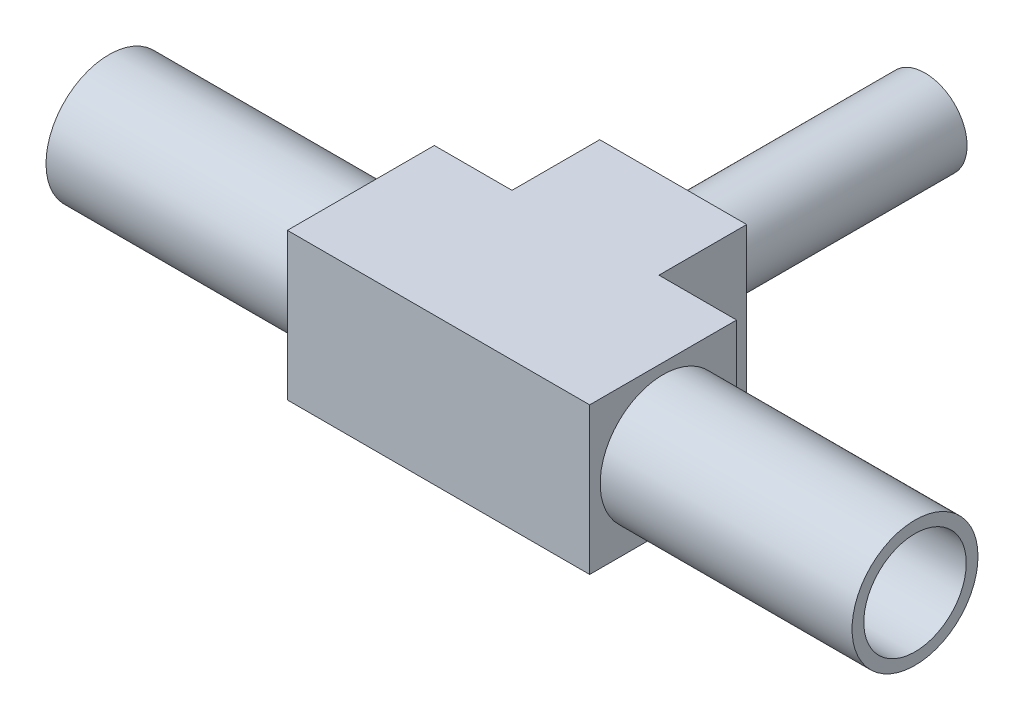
ISO-10303-21;
HEADER;
FILE_DESCRIPTION(('STEP AP214'),'2;1');
FILE_NAME('part.step','',(''),(''),'','','');
FILE_SCHEMA(('AUTOMOTIVE_DESIGN { 1 0 10303 214 1 1 1 1 }'));
ENDSEC;
DATA;
#1=APPLICATION_CONTEXT('core data for automotive mechanical design processes');
#2=APPLICATION_PROTOCOL_DEFINITION('international standard','automotive_design',2000,#1);
#3=PRODUCT_CONTEXT('',#1,'mechanical');
#4=PRODUCT('Part','Part','',(#3));
#5=PRODUCT_RELATED_PRODUCT_CATEGORY('part','',(#4));
#6=PRODUCT_DEFINITION_FORMATION('','',#4);
#7=PRODUCT_DEFINITION_CONTEXT('part definition',#1,'design');
#8=PRODUCT_DEFINITION('design','',#6,#7);
#9=PRODUCT_DEFINITION_SHAPE('','',#8);
#10=(LENGTH_UNIT() NAMED_UNIT(*) SI_UNIT(.MILLI.,.METRE.));
#11=(NAMED_UNIT(*) PLANE_ANGLE_UNIT() SI_UNIT($,.RADIAN.));
#12=(NAMED_UNIT(*) SI_UNIT($,.STERADIAN.) SOLID_ANGLE_UNIT());
#13=UNCERTAINTY_MEASURE_WITH_UNIT(LENGTH_MEASURE(1.E-05),#10,'distance_accuracy_value','');
#14=(GEOMETRIC_REPRESENTATION_CONTEXT(3) GLOBAL_UNCERTAINTY_ASSIGNED_CONTEXT((#13)) GLOBAL_UNIT_ASSIGNED_CONTEXT((#10,
#11,#12)) REPRESENTATION_CONTEXT('',''));
#15=CARTESIAN_POINT('',(0.,0.,0.));
#16=DIRECTION('',(0.,0.,1.));
#17=DIRECTION('',(1.,0.,0.));
#18=AXIS2_PLACEMENT_3D('',#15,#16,#17);
#19=CARTESIAN_POINT('',(24.92375,5.55625,0.));
#20=DIRECTION('',(-1.,0.,0.));
#21=DIRECTION('',(0.,0.,1.));
#22=AXIS2_PLACEMENT_3D('',#19,#20,#21);
#23=PLANE('',#22);
#24=DIRECTION('',(0.,1.,0.));
#25=VECTOR('',#24,1.);
#26=CARTESIAN_POINT('',(24.92375,5.55625,-5.55625));
#27=LINE('',#26,#25);
#28=CARTESIAN_POINT('',(24.92375,5.55625,-5.55625));
#29=VERTEX_POINT('',#28);
#30=CARTESIAN_POINT('',(24.92375,-5.55625,-5.55625));
#31=VERTEX_POINT('',#30);
#32=EDGE_CURVE('E230',#29,#31,#27,.F.);
#33=ORIENTED_EDGE('',*,*,#32,.F.);
#34=DIRECTION('',(0.,0.,1.));
#35=VECTOR('',#34,1.);
#36=CARTESIAN_POINT('',(24.92375,5.55625,5.55625));
#37=LINE('',#36,#35);
#38=CARTESIAN_POINT('',(24.92375,5.55625,-12.192));
#39=VERTEX_POINT('',#38);
#40=EDGE_CURVE('E233',#39,#29,#37,.T.);
#41=ORIENTED_EDGE('',*,*,#40,.F.);
#42=DIRECTION('',(0.,1.,0.));
#43=VECTOR('',#42,1.);
#44=CARTESIAN_POINT('',(24.92375,0.,-12.192));
#45=LINE('',#44,#43);
#46=CARTESIAN_POINT('',(24.92375,-5.55625,-12.192));
#47=VERTEX_POINT('',#46);
#48=EDGE_CURVE('E220',#47,#39,#45,.T.);
#49=ORIENTED_EDGE('',*,*,#48,.F.);
#50=DIRECTION('',(0.,0.,1.));
#51=VECTOR('',#50,1.);
#52=CARTESIAN_POINT('',(24.92375,-5.55625,-5.55625));
#53=LINE('',#52,#51);
#54=EDGE_CURVE('E107',#31,#47,#53,.F.);
#55=ORIENTED_EDGE('',*,*,#54,.F.);
#56=EDGE_LOOP('',(#33,#41,#49,#55));
#57=FACE_BOUND('',#56,.T.);
#58=ADVANCED_FACE('F16',(#57),#23,.T.);
#59=CARTESIAN_POINT('',(36.03625,-5.55625,0.));
#60=DIRECTION('',(1.,0.,0.));
#61=DIRECTION('',(0.,0.,-1.));
#62=AXIS2_PLACEMENT_3D('',#59,#60,#61);
#63=PLANE('',#62);
#64=DIRECTION('',(0.,1.,0.));
#65=VECTOR('',#64,1.);
#66=CARTESIAN_POINT('',(36.03625,0.,-12.192));
#67=LINE('',#66,#65);
#68=CARTESIAN_POINT('',(36.03625,5.55625,-12.192));
#69=VERTEX_POINT('',#68);
#70=CARTESIAN_POINT('',(36.03625,-5.55625,-12.192));
#71=VERTEX_POINT('',#70);
#72=EDGE_CURVE('E215',#69,#71,#67,.F.);
#73=ORIENTED_EDGE('',*,*,#72,.F.);
#74=DIRECTION('',(0.,0.,1.));
#75=VECTOR('',#74,1.);
#76=CARTESIAN_POINT('',(36.03625,5.55625,5.55625));
#77=LINE('',#76,#75);
#78=CARTESIAN_POINT('',(36.03625,5.55625,-5.55625));
#79=VERTEX_POINT('',#78);
#80=EDGE_CURVE('E111',#79,#69,#77,.F.);
#81=ORIENTED_EDGE('',*,*,#80,.F.);
#82=DIRECTION('',(0.,1.,0.));
#83=VECTOR('',#82,1.);
#84=CARTESIAN_POINT('',(36.03625,5.55625,-5.55625));
#85=LINE('',#84,#83);
#86=CARTESIAN_POINT('',(36.03625,-5.55625,-5.55625));
#87=VERTEX_POINT('',#86);
#88=EDGE_CURVE('E89',#87,#79,#85,.T.);
#89=ORIENTED_EDGE('',*,*,#88,.F.);
#90=DIRECTION('',(0.,0.,1.));
#91=VECTOR('',#90,1.);
#92=CARTESIAN_POINT('',(36.03625,-5.55625,-5.55625));
#93=LINE('',#92,#91);
#94=EDGE_CURVE('E95',#71,#87,#93,.T.);
#95=ORIENTED_EDGE('',*,*,#94,.F.);
#96=EDGE_LOOP('',(#73,#81,#89,#95));
#97=FACE_BOUND('',#96,.T.);
#98=ADVANCED_FACE('F110',(#97),#63,.T.);
#99=CARTESIAN_POINT('',(19.05,5.55625,-5.55625));
#100=DIRECTION('',(0.,0.,-1.));
#101=DIRECTION('',(-1.,0.,0.));
#102=AXIS2_PLACEMENT_3D('',#99,#100,#101);
#103=PLANE('',#102);
#104=DIRECTION('',(0.,1.,0.));
#105=VECTOR('',#104,1.);
#106=CARTESIAN_POINT('',(41.91,0.,-5.55625));
#107=LINE('',#106,#105);
#108=CARTESIAN_POINT('',(41.91,-5.55625,-5.55625));
#109=VERTEX_POINT('',#108);
#110=CARTESIAN_POINT('',(41.91,5.55625,-5.55625));
#111=VERTEX_POINT('',#110);
#112=EDGE_CURVE('E117',#109,#111,#107,.T.);
#113=ORIENTED_EDGE('',*,*,#112,.F.);
#114=DIRECTION('',(1.,0.,0.));
#115=VECTOR('',#114,1.);
#116=CARTESIAN_POINT('',(19.05,-5.55625,-5.55625));
#117=LINE('',#116,#115);
#118=EDGE_CURVE('E99',#87,#109,#117,.T.);
#119=ORIENTED_EDGE('',*,*,#118,.F.);
#120=ORIENTED_EDGE('',*,*,#88,.T.);
#121=DIRECTION('',(1.,0.,0.));
#122=VECTOR('',#121,1.);
#123=CARTESIAN_POINT('',(19.05,5.55625,-5.55625));
#124=LINE('',#123,#122);
#125=EDGE_CURVE('E237',#111,#79,#124,.F.);
#126=ORIENTED_EDGE('',*,*,#125,.F.);
#127=EDGE_LOOP('',(#113,#119,#120,#126));
#128=FACE_BOUND('',#127,.T.);
#129=ADVANCED_FACE('F115',(#128),#103,.T.);
#130=CARTESIAN_POINT('',(19.05,-5.55625,-5.55625));
#131=DIRECTION('',(0.,-1.,0.));
#132=DIRECTION('',(1.,0.,0.));
#133=AXIS2_PLACEMENT_3D('',#130,#131,#132);
#134=PLANE('',#133);
#135=DIRECTION('',(0.,0.,1.));
#136=VECTOR('',#135,1.);
#137=CARTESIAN_POINT('',(19.05,-5.55625,-2.778125));
#138=LINE('',#137,#136);
#139=CARTESIAN_POINT('',(19.05,-5.55625,-5.55625));
#140=VERTEX_POINT('',#139);
#141=CARTESIAN_POINT('',(19.05,-5.55625,5.55625));
#142=VERTEX_POINT('',#141);
#143=EDGE_CURVE('E201',#140,#142,#138,.T.);
#144=ORIENTED_EDGE('',*,*,#143,.F.);
#145=DIRECTION('',(-1.,0.,0.));
#146=VECTOR('',#145,1.);
#147=CARTESIAN_POINT('',(19.05,-5.55625,-5.55625));
#148=LINE('',#147,#146);
#149=EDGE_CURVE('E228',#31,#140,#148,.T.);
#150=ORIENTED_EDGE('',*,*,#149,.F.);
#151=ORIENTED_EDGE('',*,*,#54,.T.);
#152=DIRECTION('',(-1.,0.,0.));
#153=VECTOR('',#152,1.);
#154=CARTESIAN_POINT('',(33.258125,-5.55625,-12.192));
#155=LINE('',#154,#153);
#156=EDGE_CURVE('E102',#71,#47,#155,.T.);
#157=ORIENTED_EDGE('',*,*,#156,.F.);
#158=ORIENTED_EDGE('',*,*,#94,.T.);
#159=ORIENTED_EDGE('',*,*,#118,.T.);
#160=DIRECTION('',(0.,0.,1.));
#161=VECTOR('',#160,1.);
#162=CARTESIAN_POINT('',(41.91,-5.55625,-2.778125));
#163=LINE('',#162,#161);
#164=CARTESIAN_POINT('',(41.91,-5.55625,5.55625));
#165=VERTEX_POINT('',#164);
#166=EDGE_CURVE('E206',#165,#109,#163,.F.);
#167=ORIENTED_EDGE('',*,*,#166,.F.);
#168=DIRECTION('',(1.,0.,0.));
#169=VECTOR('',#168,1.);
#170=CARTESIAN_POINT('',(19.05,-5.55625,5.55625));
#171=LINE('',#170,#169);
#172=EDGE_CURVE('E119',#142,#165,#171,.T.);
#173=ORIENTED_EDGE('',*,*,#172,.F.);
#174=EDGE_LOOP('',(#144,#150,#151,#157,#158,#159,#167,#173));
#175=FACE_BOUND('',#174,.T.);
#176=ADVANCED_FACE('F97',(#175),#134,.T.);
#177=CARTESIAN_POINT('',(19.05,-5.55625,5.55625));
#178=DIRECTION('',(0.,0.,1.));
#179=DIRECTION('',(0.,-1.,0.));
#180=AXIS2_PLACEMENT_3D('',#177,#178,#179);
#181=PLANE('',#180);
#182=DIRECTION('',(0.,1.,0.));
#183=VECTOR('',#182,1.);
#184=CARTESIAN_POINT('',(41.91,0.,5.55625));
#185=LINE('',#184,#183);
#186=CARTESIAN_POINT('',(41.91,5.55625,5.55625));
#187=VERTEX_POINT('',#186);
#188=EDGE_CURVE('E208',#187,#165,#185,.F.);
#189=ORIENTED_EDGE('',*,*,#188,.F.);
#190=DIRECTION('',(1.,0.,0.));
#191=VECTOR('',#190,1.);
#192=CARTESIAN_POINT('',(19.05,5.55625,5.55625));
#193=LINE('',#192,#191);
#194=CARTESIAN_POINT('',(19.05,5.55625,5.55625));
#195=VERTEX_POINT('',#194);
#196=EDGE_CURVE('E125',#195,#187,#193,.T.);
#197=ORIENTED_EDGE('',*,*,#196,.F.);
#198=DIRECTION('',(0.,1.,0.));
#199=VECTOR('',#198,1.);
#200=CARTESIAN_POINT('',(19.05,0.,5.55625));
#201=LINE('',#200,#199);
#202=EDGE_CURVE('E196',#142,#195,#201,.T.);
#203=ORIENTED_EDGE('',*,*,#202,.F.);
#204=ORIENTED_EDGE('',*,*,#172,.T.);
#205=EDGE_LOOP('',(#189,#197,#203,#204));
#206=FACE_BOUND('',#205,.T.);
#207=ADVANCED_FACE('F251',(#206),#181,.T.);
#208=CARTESIAN_POINT('',(19.05,5.55625,5.55625));
#209=DIRECTION('',(0.,1.,0.));
#210=DIRECTION('',(0.,0.,1.));
#211=AXIS2_PLACEMENT_3D('',#208,#209,#210);
#212=PLANE('',#211);
#213=DIRECTION('',(-1.,0.,0.));
#214=VECTOR('',#213,1.);
#215=CARTESIAN_POINT('',(33.258125,5.55625,-12.192));
#216=LINE('',#215,#214);
#217=EDGE_CURVE('E217',#39,#69,#216,.F.);
#218=ORIENTED_EDGE('',*,*,#217,.F.);
#219=ORIENTED_EDGE('',*,*,#40,.T.);
#220=DIRECTION('',(-1.,0.,0.));
#221=VECTOR('',#220,1.);
#222=CARTESIAN_POINT('',(19.05,5.55625,-5.55625));
#223=LINE('',#222,#221);
#224=CARTESIAN_POINT('',(19.05,5.55625,-5.55625));
#225=VERTEX_POINT('',#224);
#226=EDGE_CURVE('E225',#225,#29,#223,.F.);
#227=ORIENTED_EDGE('',*,*,#226,.F.);
#228=DIRECTION('',(0.,0.,1.));
#229=VECTOR('',#228,1.);
#230=CARTESIAN_POINT('',(19.05,5.55625,-2.778125));
#231=LINE('',#230,#229);
#232=EDGE_CURVE('E34',#195,#225,#231,.F.);
#233=ORIENTED_EDGE('',*,*,#232,.F.);
#234=ORIENTED_EDGE('',*,*,#196,.T.);
#235=DIRECTION('',(0.,0.,1.));
#236=VECTOR('',#235,1.);
#237=CARTESIAN_POINT('',(41.91,5.55625,-2.778125));
#238=LINE('',#237,#236);
#239=EDGE_CURVE('E212',#111,#187,#238,.T.);
#240=ORIENTED_EDGE('',*,*,#239,.F.);
#241=ORIENTED_EDGE('',*,*,#125,.T.);
#242=ORIENTED_EDGE('',*,*,#80,.T.);
#243=EDGE_LOOP('',(#218,#219,#227,#233,#234,#240,#241,#242));
#244=FACE_BOUND('',#243,.T.);
#245=ADVANCED_FACE('F244',(#244),#212,.T.);
#246=CARTESIAN_POINT('',(19.05,5.55625,-5.55625));
#247=DIRECTION('',(0.,0.,-1.));
#248=DIRECTION('',(-1.,0.,0.));
#249=AXIS2_PLACEMENT_3D('',#246,#247,#248);
#250=PLANE('',#249);
#251=DIRECTION('',(0.,1.,0.));
#252=VECTOR('',#251,1.);
#253=CARTESIAN_POINT('',(19.05,0.,-5.55625));
#254=LINE('',#253,#252);
#255=EDGE_CURVE('E187',#225,#140,#254,.F.);
#256=ORIENTED_EDGE('',*,*,#255,.F.);
#257=ORIENTED_EDGE('',*,*,#226,.T.);
#258=ORIENTED_EDGE('',*,*,#32,.T.);
#259=ORIENTED_EDGE('',*,*,#149,.T.);
#260=EDGE_LOOP('',(#256,#257,#258,#259));
#261=FACE_BOUND('',#260,.T.);
#262=ADVANCED_FACE('F287',(#261),#250,.T.);
#263=CARTESIAN_POINT('',(33.258125,0.,-12.192));
#264=DIRECTION('',(0.,0.,-1.));
#265=DIRECTION('',(-1.,0.,0.));
#266=AXIS2_PLACEMENT_3D('',#263,#264,#265);
#267=PLANE('',#266);
#268=ORIENTED_EDGE('',*,*,#217,.T.);
#269=ORIENTED_EDGE('',*,*,#72,.T.);
#270=ORIENTED_EDGE('',*,*,#156,.T.);
#271=ORIENTED_EDGE('',*,*,#48,.T.);
#272=EDGE_LOOP('',(#268,#269,#270,#271));
#273=FACE_BOUND('',#272,.T.);
#274=CARTESIAN_POINT('',(30.48,0.,-12.192));
#275=DIRECTION('',(0.,0.,-1.));
#276=DIRECTION('',(-1.,0.,0.));
#277=AXIS2_PLACEMENT_3D('',#274,#275,#276);
#278=CIRCLE('',#277,3.175);
#279=CARTESIAN_POINT('',(27.305,0.,-12.192));
#280=VERTEX_POINT('',#279);
#281=EDGE_CURVE('E19',#280,#280,#278,.T.);
#282=ORIENTED_EDGE('',*,*,#281,.F.);
#283=EDGE_LOOP('',(#282));
#284=FACE_BOUND('',#283,.T.);
#285=ADVANCED_FACE('F284',(#273,#284),#267,.T.);
#286=CARTESIAN_POINT('',(41.91,0.,-2.778125));
#287=DIRECTION('',(1.,0.,0.));
#288=DIRECTION('',(0.,1.,0.));
#289=AXIS2_PLACEMENT_3D('',#286,#287,#288);
#290=PLANE('',#289);
#291=ORIENTED_EDGE('',*,*,#166,.T.);
#292=ORIENTED_EDGE('',*,*,#112,.T.);
#293=ORIENTED_EDGE('',*,*,#239,.T.);
#294=ORIENTED_EDGE('',*,*,#188,.T.);
#295=EDGE_LOOP('',(#291,#292,#293,#294));
#296=FACE_BOUND('',#295,.T.);
#297=CARTESIAN_POINT('',(41.91,0.,0.));
#298=DIRECTION('',(1.,0.,0.));
#299=DIRECTION('',(0.,0.,-1.));
#300=AXIS2_PLACEMENT_3D('',#297,#298,#299);
#301=CIRCLE('',#300,4.7625);
#302=CARTESIAN_POINT('',(41.91,0.,-4.7625));
#303=VERTEX_POINT('',#302);
#304=EDGE_CURVE('E181',#303,#303,#301,.T.);
#305=ORIENTED_EDGE('',*,*,#304,.F.);
#306=EDGE_LOOP('',(#305));
#307=FACE_BOUND('',#306,.T.);
#308=ADVANCED_FACE('F249',(#296,#307),#290,.T.);
#309=CARTESIAN_POINT('',(19.05,0.,-2.778125));
#310=DIRECTION('',(-1.,0.,0.));
#311=DIRECTION('',(0.,0.,1.));
#312=AXIS2_PLACEMENT_3D('',#309,#310,#311);
#313=PLANE('',#312);
#314=ORIENTED_EDGE('',*,*,#232,.T.);
#315=ORIENTED_EDGE('',*,*,#255,.T.);
#316=ORIENTED_EDGE('',*,*,#143,.T.);
#317=ORIENTED_EDGE('',*,*,#202,.T.);
#318=EDGE_LOOP('',(#314,#315,#316,#317));
#319=FACE_BOUND('',#318,.T.);
#320=CARTESIAN_POINT('',(19.05,0.,0.));
#321=DIRECTION('',(-1.,0.,0.));
#322=DIRECTION('',(0.,0.,1.));
#323=AXIS2_PLACEMENT_3D('',#320,#321,#322);
#324=CIRCLE('',#323,4.7625);
#325=CARTESIAN_POINT('',(19.05,0.,4.7625));
#326=VERTEX_POINT('',#325);
#327=EDGE_CURVE('E178',#326,#326,#324,.T.);
#328=ORIENTED_EDGE('',*,*,#327,.F.);
#329=EDGE_LOOP('',(#328));
#330=FACE_BOUND('',#329,.T.);
#331=ADVANCED_FACE('F254',(#319,#330),#313,.T.);
#332=CARTESIAN_POINT('',(30.48,0.,-21.717));
#333=DIRECTION('',(0.,0.,-1.));
#334=DIRECTION('',(-1.,0.,0.));
#335=AXIS2_PLACEMENT_3D('',#332,#333,#334);
#336=CYLINDRICAL_SURFACE('',#335,3.175);
#337=CARTESIAN_POINT('',(30.48,0.,-31.242));
#338=DIRECTION('',(0.,0.,-1.));
#339=DIRECTION('',(-1.,0.,0.));
#340=AXIS2_PLACEMENT_3D('',#337,#338,#339);
#341=CIRCLE('',#340,3.175);
#342=CARTESIAN_POINT('',(27.305,0.,-31.242));
#343=VERTEX_POINT('',#342);
#344=EDGE_CURVE('E174',#343,#343,#341,.T.);
#345=ORIENTED_EDGE('',*,*,#344,.F.);
#346=EDGE_LOOP('',(#345));
#347=FACE_BOUND('',#346,.T.);
#348=ORIENTED_EDGE('',*,*,#281,.T.);
#349=EDGE_LOOP('',(#348));
#350=FACE_BOUND('',#349,.T.);
#351=ADVANCED_FACE('F257',(#347,#350),#336,.T.);
#352=CARTESIAN_POINT('',(51.435,0.,0.));
#353=DIRECTION('',(1.,0.,0.));
#354=DIRECTION('',(0.,0.,-1.));
#355=AXIS2_PLACEMENT_3D('',#352,#353,#354);
#356=CYLINDRICAL_SURFACE('',#355,4.7625);
#357=CARTESIAN_POINT('',(60.96,0.,0.));
#358=DIRECTION('',(1.,0.,0.));
#359=DIRECTION('',(0.,0.,-1.));
#360=AXIS2_PLACEMENT_3D('',#357,#358,#359);
#361=CIRCLE('',#360,4.7625);
#362=CARTESIAN_POINT('',(60.96,0.,-4.7625));
#363=VERTEX_POINT('',#362);
#364=EDGE_CURVE('E171',#363,#363,#361,.T.);
#365=ORIENTED_EDGE('',*,*,#364,.F.);
#366=EDGE_LOOP('',(#365));
#367=FACE_BOUND('',#366,.T.);
#368=ORIENTED_EDGE('',*,*,#304,.T.);
#369=EDGE_LOOP('',(#368));
#370=FACE_BOUND('',#369,.T.);
#371=ADVANCED_FACE('F264',(#367,#370),#356,.T.);
#372=CARTESIAN_POINT('',(9.525,0.,0.));
#373=DIRECTION('',(-1.,0.,0.));
#374=DIRECTION('',(0.,0.,1.));
#375=AXIS2_PLACEMENT_3D('',#372,#373,#374);
#376=CYLINDRICAL_SURFACE('',#375,4.7625);
#377=CARTESIAN_POINT('',(0.,0.,0.));
#378=DIRECTION('',(-1.,0.,0.));
#379=DIRECTION('',(0.,0.,1.));
#380=AXIS2_PLACEMENT_3D('',#377,#378,#379);
#381=CIRCLE('',#380,4.7625);
#382=CARTESIAN_POINT('',(0.,0.,4.7625));
#383=VERTEX_POINT('',#382);
#384=EDGE_CURVE('E165',#383,#383,#381,.T.);
#385=ORIENTED_EDGE('',*,*,#384,.F.);
#386=EDGE_LOOP('',(#385));
#387=FACE_BOUND('',#386,.T.);
#388=ORIENTED_EDGE('',*,*,#327,.T.);
#389=EDGE_LOOP('',(#388));
#390=FACE_BOUND('',#389,.T.);
#391=ADVANCED_FACE('F261',(#387,#390),#376,.T.);
#392=CARTESIAN_POINT('',(32.0675,0.,-31.242));
#393=DIRECTION('',(0.,0.,-1.));
#394=DIRECTION('',(-1.,0.,0.));
#395=AXIS2_PLACEMENT_3D('',#392,#393,#394);
#396=PLANE('',#395);
#397=ORIENTED_EDGE('',*,*,#344,.T.);
#398=EDGE_LOOP('',(#397));
#399=FACE_BOUND('',#398,.T.);
#400=CARTESIAN_POINT('',(30.48,0.,-31.242));
#401=DIRECTION('',(0.,0.,1.));
#402=DIRECTION('',(1.,0.,0.));
#403=AXIS2_PLACEMENT_3D('',#400,#401,#402);
#404=CIRCLE('',#403,2.286);
#405=CARTESIAN_POINT('',(32.766,0.,-31.242));
#406=VERTEX_POINT('',#405);
#407=EDGE_CURVE('E159',#406,#406,#404,.T.);
#408=ORIENTED_EDGE('',*,*,#407,.T.);
#409=EDGE_LOOP('',(#408));
#410=FACE_BOUND('',#409,.T.);
#411=ADVANCED_FACE('F263',(#399,#410),#396,.T.);
#412=CARTESIAN_POINT('',(60.96,0.,2.38125));
#413=DIRECTION('',(1.,0.,0.));
#414=DIRECTION('',(0.,0.,-1.));
#415=AXIS2_PLACEMENT_3D('',#412,#413,#414);
#416=PLANE('',#415);
#417=ORIENTED_EDGE('',*,*,#364,.T.);
#418=EDGE_LOOP('',(#417));
#419=FACE_BOUND('',#418,.T.);
#420=CARTESIAN_POINT('',(60.96,0.,0.));
#421=DIRECTION('',(1.,0.,0.));
#422=DIRECTION('',(0.,0.,-1.));
#423=AXIS2_PLACEMENT_3D('',#420,#421,#422);
#424=CIRCLE('',#423,3.8735);
#425=CARTESIAN_POINT('',(60.96,0.,-3.8735));
#426=VERTEX_POINT('',#425);
#427=EDGE_CURVE('E156',#426,#426,#424,.F.);
#428=ORIENTED_EDGE('',*,*,#427,.T.);
#429=EDGE_LOOP('',(#428));
#430=FACE_BOUND('',#429,.T.);
#431=ADVANCED_FACE('F271',(#419,#430),#416,.T.);
#432=CARTESIAN_POINT('',(0.,0.,-2.38125));
#433=DIRECTION('',(-1.,0.,0.));
#434=DIRECTION('',(0.,0.,1.));
#435=AXIS2_PLACEMENT_3D('',#432,#433,#434);
#436=PLANE('',#435);
#437=ORIENTED_EDGE('',*,*,#384,.T.);
#438=EDGE_LOOP('',(#437));
#439=FACE_BOUND('',#438,.T.);
#440=CARTESIAN_POINT('',(0.,0.,0.));
#441=DIRECTION('',(1.,0.,0.));
#442=DIRECTION('',(0.,0.,-1.));
#443=AXIS2_PLACEMENT_3D('',#440,#441,#442);
#444=CIRCLE('',#443,3.8735);
#445=CARTESIAN_POINT('',(0.,0.,-3.8735));
#446=VERTEX_POINT('',#445);
#447=EDGE_CURVE('E25',#446,#446,#444,.T.);
#448=ORIENTED_EDGE('',*,*,#447,.T.);
#449=EDGE_LOOP('',(#448));
#450=FACE_BOUND('',#449,.T.);
#451=ADVANCED_FACE('F147',(#439,#450),#436,.T.);
#452=CARTESIAN_POINT('',(30.48,0.,-15.621));
#453=DIRECTION('',(0.,0.,1.));
#454=DIRECTION('',(1.,0.,0.));
#455=AXIS2_PLACEMENT_3D('',#452,#453,#454);
#456=CYLINDRICAL_SURFACE('',#455,2.286);
#457=ORIENTED_EDGE('',*,*,#407,.F.);
#458=EDGE_LOOP('',(#457));
#459=FACE_BOUND('',#458,.T.);
#460=CARTESIAN_POINT('',(28.194,0.,-3.8735));
#461=CARTESIAN_POINT('',(28.194005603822,-0.11724689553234,-3.87349492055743));
#462=CARTESIAN_POINT('',(28.2030839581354,-0.234696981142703,-3.86811781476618));
#463=CARTESIAN_POINT('',(28.2389419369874,-0.466084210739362,-3.8471213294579));
#464=CARTESIAN_POINT('',(28.2657678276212,-0.58001135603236,-3.83147518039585));
#465=CARTESIAN_POINT('',(28.3356353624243,-0.800502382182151,-3.79152889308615));
#466=CARTESIAN_POINT('',(28.3785971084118,-0.907099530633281,-3.76727142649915));
#467=CARTESIAN_POINT('',(28.4790318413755,-1.11125023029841,-3.71218532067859));
#468=CARTESIAN_POINT('',(28.5365006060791,-1.20880640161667,-3.68135859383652));
#469=CARTESIAN_POINT('',(28.6691288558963,-1.40039988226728,-3.61303002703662));
#470=CARTESIAN_POINT('',(28.74529258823,-1.49362311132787,-3.57520079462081));
#471=CARTESIAN_POINT('',(28.9109014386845,-1.6667645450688,-3.49784373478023));
#472=CARTESIAN_POINT('',(29.0003628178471,-1.7466662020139,-3.45831387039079));
#473=CARTESIAN_POINT('',(29.2024408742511,-1.9004220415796,-3.3765121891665));
#474=CARTESIAN_POINT('',(29.3165434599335,-1.97245914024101,-3.33446483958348));
#475=CARTESIAN_POINT('',(29.5577139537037,-2.09606172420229,-3.25819372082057));
#476=CARTESIAN_POINT('',(29.684763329,-2.14765596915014,-3.22395898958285));
#477=CARTESIAN_POINT('',(29.9228439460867,-2.21983231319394,-3.17456736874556));
#478=CARTESIAN_POINT('',(30.0321195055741,-2.24451536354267,-3.15698396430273));
#479=CARTESIAN_POINT('',(30.2542654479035,-2.27758888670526,-3.13321333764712));
#480=CARTESIAN_POINT('',(30.367130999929,-2.28600038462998,-3.12701140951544));
#481=CARTESIAN_POINT('',(30.5954664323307,-2.28599960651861,-3.12701331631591));
#482=CARTESIAN_POINT('',(30.7109364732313,-2.27719571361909,-3.13350592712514));
#483=CARTESIAN_POINT('',(30.9380262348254,-2.24259570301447,-3.15835345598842));
#484=CARTESIAN_POINT('',(31.0496415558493,-2.21678080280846,-3.17672148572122));
#485=CARTESIAN_POINT('',(31.2652579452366,-2.1498462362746,-3.22238608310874));
#486=CARTESIAN_POINT('',(31.3693062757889,-2.10883349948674,-3.24962011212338));
#487=CARTESIAN_POINT('',(31.5689850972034,-2.01300434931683,-3.3098357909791));
#488=CARTESIAN_POINT('',(31.66461298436,-1.9581836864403,-3.34281920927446));
#489=CARTESIAN_POINT('',(31.8571058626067,-1.82876062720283,-3.41551845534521));
#490=CARTESIAN_POINT('',(31.9527890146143,-1.75258850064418,-3.45556962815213));
#491=CARTESIAN_POINT('',(32.1310036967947,-1.58583973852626,-3.53520328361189));
#492=CARTESIAN_POINT('',(32.2135249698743,-1.49525197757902,-3.57478537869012));
#493=CARTESIAN_POINT('',(32.3715081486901,-1.29087048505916,-3.65388285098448));
#494=CARTESIAN_POINT('',(32.4453543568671,-1.17564513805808,-3.6929669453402));
#495=CARTESIAN_POINT('',(32.5720240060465,-0.93169085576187,-3.761906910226));
#496=CARTESIAN_POINT('',(32.6248757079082,-0.802980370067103,-3.79177517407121));
#497=CARTESIAN_POINT('',(32.6986478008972,-0.562152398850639,-3.8340436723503));
#498=CARTESIAN_POINT('',(32.7237947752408,-0.451722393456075,-3.8487193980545));
#499=CARTESIAN_POINT('',(32.7574663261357,-0.227528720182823,-3.86844503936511));
#500=CARTESIAN_POINT('',(32.7660003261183,-0.11376697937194,-3.87350041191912));
#501=CARTESIAN_POINT('',(32.7659996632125,0.117488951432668,-3.87349957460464));
#502=CARTESIAN_POINT('',(32.7568974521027,0.23498348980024,-3.86810714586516));
#503=CARTESIAN_POINT('',(32.7209984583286,0.466301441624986,-3.84708620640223));
#504=CARTESIAN_POINT('',(32.6941938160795,0.580123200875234,-3.83145314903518));
#505=CARTESIAN_POINT('',(32.6243734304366,0.800483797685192,-3.79153402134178));
#506=CARTESIAN_POINT('',(32.5814237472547,0.907050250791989,-3.76728323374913));
#507=CARTESIAN_POINT('',(32.4809957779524,1.11120098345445,-3.7122001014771));
#508=CARTESIAN_POINT('',(32.4235147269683,1.20878354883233,-3.68136650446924));
#509=CARTESIAN_POINT('',(32.2908689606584,1.4004037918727,-3.61302889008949));
#510=CARTESIAN_POINT('',(32.2147026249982,1.49362935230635,-3.57519832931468));
#511=CARTESIAN_POINT('',(32.0490925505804,1.66676959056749,-3.49784115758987));
#512=CARTESIAN_POINT('',(31.9596334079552,1.74666859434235,-3.45831261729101));
#513=CARTESIAN_POINT('',(31.7575505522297,1.90042910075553,-3.37650841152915));
#514=CARTESIAN_POINT('',(31.6434395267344,1.97247139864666,-3.33445746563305));
#515=CARTESIAN_POINT('',(31.4022607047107,2.09607118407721,-3.25818769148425));
#516=CARTESIAN_POINT('',(31.2752137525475,2.14766099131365,-3.22395654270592));
#517=CARTESIAN_POINT('',(31.0421991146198,2.21830493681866,-3.17561182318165));
#518=CARTESIAN_POINT('',(30.9382746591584,2.24215174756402,-3.15866306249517));
#519=CARTESIAN_POINT('',(30.7270205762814,2.27511985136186,-3.13500568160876));
#520=CARTESIAN_POINT('',(30.6196951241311,2.28425853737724,-3.12828496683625));
#521=CARTESIAN_POINT('',(30.4045237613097,2.28729043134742,-3.12606943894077));
#522=CARTESIAN_POINT('',(30.2966772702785,2.28115711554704,-3.13059415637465));
#523=CARTESIAN_POINT('',(30.0838449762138,2.25397127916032,-3.15021943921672));
#524=CARTESIAN_POINT('',(29.9788613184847,2.23290787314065,-3.16532772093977));
#525=CARTESIAN_POINT('',(29.7753548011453,2.17722477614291,-3.20387469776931));
#526=CARTESIAN_POINT('',(29.6767798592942,2.14273633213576,-3.22723254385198));
#527=CARTESIAN_POINT('',(29.4865387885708,2.06144255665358,-3.2797551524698));
#528=CARTESIAN_POINT('',(29.3948752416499,2.01463265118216,-3.30892207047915));
#529=CARTESIAN_POINT('',(29.2045177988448,1.90085207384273,-3.37576879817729));
#530=CARTESIAN_POINT('',(29.1072748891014,1.83180739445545,-3.41405304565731));
#531=CARTESIAN_POINT('',(28.9247709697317,1.6796408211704,-3.49143321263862));
#532=CARTESIAN_POINT('',(28.8395213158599,1.59650574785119,-3.53052986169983));
#533=CARTESIAN_POINT('',(28.6722004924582,1.40562693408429,-3.61113426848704));
#534=CARTESIAN_POINT('',(28.5919882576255,1.29608846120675,-3.65229320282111));
#535=CARTESIAN_POINT('',(28.4513775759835,1.06254692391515,-3.72692411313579));
#536=CARTESIAN_POINT('',(28.3909657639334,0.938553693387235,-3.76040126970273));
#537=CARTESIAN_POINT('',(28.3022471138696,0.70412518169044,-3.81047928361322));
#538=CARTESIAN_POINT('',(28.2700211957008,0.595590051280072,-3.82907811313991));
#539=CARTESIAN_POINT('',(28.221966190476,0.373970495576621,-3.85701073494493));
#540=CARTESIAN_POINT('',(28.2060892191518,0.26090036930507,-3.86637158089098));
#541=CARTESIAN_POINT('',(28.1971656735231,0.122765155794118,-3.87163270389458));
#542=CARTESIAN_POINT('',(28.1959796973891,0.0982358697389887,-3.87233192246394));
#543=CARTESIAN_POINT('',(28.1943962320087,0.0491407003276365,-3.87326612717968));
#544=CARTESIAN_POINT('',(28.1939988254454,0.0245748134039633,-3.87350106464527));
#545=CARTESIAN_POINT('',(28.194,0.,-3.8735));
#546=B_SPLINE_CURVE_WITH_KNOTS('',3,(#460,#461,#462,#463,#464,#465,#466,#467,#468,#469,#470,
#471,#472,#473,#474,#475,#476,#477,#478,#479,#480,#481,#482,#483,#484,#485,#486,#487,#488,#489,
#490,#491,#492,#493,#494,#495,#496,#497,#498,#499,#500,#501,#502,#503,#504,#505,#506,#507,#508,
#509,#510,#511,#512,#513,#514,#515,#516,#517,#518,#519,#520,#521,#522,#523,#524,#525,#526,#527,
#528,#529,#530,#531,#532,#533,#534,#535,#536,#537,#538,#539,#540,#541,#542,#543,#544,#545),
.UNSPECIFIED.,.T.,.F.,(4,2,2,2,2,2,2,2,2,2,2,2,2,2,2,2,2,2,2,2,2,2,2,2,2,2,2,2,2,2,2,2,2,2,2,2,
2,2,2,2,2,2,4),(0.,0.351635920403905,0.704192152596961,1.05502520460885,1.40575626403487,
1.78281942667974,2.16034753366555,2.58228632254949,3.0036293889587,3.34220857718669,
3.68034998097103,4.02627296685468,4.37257854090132,4.7164924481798,5.06051232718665,
5.44506674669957,5.82991940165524,6.25462127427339,6.67874949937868,7.01980917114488,
7.36067532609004,7.71269317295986,8.06486741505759,8.41561608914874,8.76643155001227,
9.14350697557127,9.5210228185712,9.94299850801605,10.3643046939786,10.6868148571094,
11.0089433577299,11.3316317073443,11.6545555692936,11.9743986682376,12.2943606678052,
12.6686773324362,13.0433460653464,13.4667957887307,13.8899590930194,14.2327212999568,
14.5744767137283,14.6481714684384,14.7218739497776),.UNSPECIFIED.);
#547=CARTESIAN_POINT('',(28.194,0.,-3.8735));
#548=VERTEX_POINT('',#547);
#549=EDGE_CURVE('E11',#548,#548,#546,.T.);
#550=ORIENTED_EDGE('',*,*,#549,.T.);
#551=EDGE_LOOP('',(#550));
#552=FACE_BOUND('',#551,.T.);
#553=ADVANCED_FACE('F136',(#459,#552),#456,.F.);
#554=CARTESIAN_POINT('',(30.48,0.,0.));
#555=DIRECTION('',(1.,0.,0.));
#556=DIRECTION('',(0.,0.,-1.));
#557=AXIS2_PLACEMENT_3D('',#554,#555,#556);
#558=CYLINDRICAL_SURFACE('',#557,3.8735);
#559=ORIENTED_EDGE('',*,*,#447,.F.);
#560=EDGE_LOOP('',(#559));
#561=FACE_BOUND('',#560,.T.);
#562=ORIENTED_EDGE('',*,*,#549,.F.);
#563=EDGE_LOOP('',(#562));
#564=FACE_BOUND('',#563,.T.);
#565=ORIENTED_EDGE('',*,*,#427,.F.);
#566=EDGE_LOOP('',(#565));
#567=FACE_BOUND('',#566,.T.);
#568=ADVANCED_FACE('F139',(#561,#564,#567),#558,.F.);
#569=CLOSED_SHELL('',(#58,#98,#129,#176,#207,#245,#262,#285,#308,#331,#351,#371,#391,#411,#431,
#451,#553,#568));
#570=MANIFOLD_SOLID_BREP('B1',#569);
#571=ADVANCED_BREP_SHAPE_REPRESENTATION('',(#18,#570),#14);
#572=SHAPE_DEFINITION_REPRESENTATION(#9,#571);
ENDSEC;
END-ISO-10303-21;
